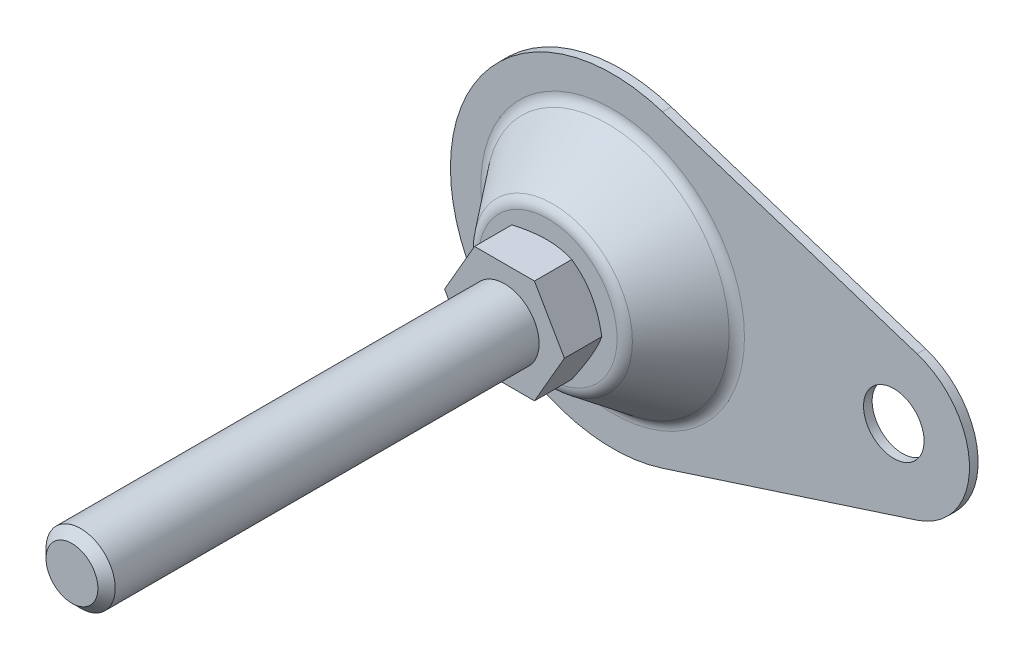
ISO-10303-21;
HEADER;
FILE_DESCRIPTION(('STEP AP214'),'2;1');
FILE_NAME('part.step','',(''),(''),'','','');
FILE_SCHEMA(('AUTOMOTIVE_DESIGN { 1 0 10303 214 1 1 1 1 }'));
ENDSEC;
DATA;
#1=APPLICATION_CONTEXT('core data for automotive mechanical design processes');
#2=APPLICATION_PROTOCOL_DEFINITION('international standard','automotive_design',2000,#1);
#3=PRODUCT_CONTEXT('',#1,'mechanical');
#4=PRODUCT('Part','Part','',(#3));
#5=PRODUCT_RELATED_PRODUCT_CATEGORY('part','',(#4));
#6=PRODUCT_DEFINITION_FORMATION('','',#4);
#7=PRODUCT_DEFINITION_CONTEXT('part definition',#1,'design');
#8=PRODUCT_DEFINITION('design','',#6,#7);
#9=PRODUCT_DEFINITION_SHAPE('','',#8);
#10=(LENGTH_UNIT() NAMED_UNIT(*) SI_UNIT(.MILLI.,.METRE.));
#11=(NAMED_UNIT(*) PLANE_ANGLE_UNIT() SI_UNIT($,.RADIAN.));
#12=(NAMED_UNIT(*) SI_UNIT($,.STERADIAN.) SOLID_ANGLE_UNIT());
#13=UNCERTAINTY_MEASURE_WITH_UNIT(LENGTH_MEASURE(1.E-05),#10,'distance_accuracy_value','');
#14=(GEOMETRIC_REPRESENTATION_CONTEXT(3) GLOBAL_UNCERTAINTY_ASSIGNED_CONTEXT((#13)) GLOBAL_UNIT_ASSIGNED_CONTEXT((#10,
#11,#12)) REPRESENTATION_CONTEXT('',''));
#15=CARTESIAN_POINT('',(0.,0.,0.));
#16=DIRECTION('',(0.,0.,1.));
#17=DIRECTION('',(1.,0.,0.));
#18=AXIS2_PLACEMENT_3D('',#15,#16,#17);
#19=CARTESIAN_POINT('',(65.,0.,2.));
#20=DIRECTION('',(0.,0.,1.));
#21=DIRECTION('',(1.,0.,0.));
#22=AXIS2_PLACEMENT_3D('',#19,#20,#21);
#23=PLANE('',#22);
#24=CARTESIAN_POINT('',(0.,0.,2.));
#25=DIRECTION('',(0.,0.,1.));
#26=DIRECTION('',(1.,0.,0.));
#27=AXIS2_PLACEMENT_3D('',#24,#25,#26);
#28=CIRCLE('',#27,30.4802116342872);
#29=CARTESIAN_POINT('',(30.4802116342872,0.,2.));
#30=VERTEX_POINT('',#29);
#31=EDGE_CURVE('E245',#30,#30,#28,.F.);
#32=ORIENTED_EDGE('',*,*,#31,.T.);
#33=EDGE_LOOP('',(#32));
#34=FACE_BOUND('',#33,.T.);
#35=CARTESIAN_POINT('',(65.,0.,2.));
#36=DIRECTION('',(0.,0.,1.));
#37=DIRECTION('',(1.,0.,0.));
#38=AXIS2_PLACEMENT_3D('',#35,#36,#37);
#39=CIRCLE('',#38,7.);
#40=CARTESIAN_POINT('',(72.,0.,2.));
#41=VERTEX_POINT('',#40);
#42=EDGE_CURVE('E262',#41,#41,#39,.T.);
#43=ORIENTED_EDGE('',*,*,#42,.F.);
#44=EDGE_LOOP('',(#43));
#45=FACE_BOUND('',#44,.T.);
#46=DIRECTION('',(-0.951485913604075,0.307692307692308,0.));
#47=VECTOR('',#46,1.);
#48=CARTESIAN_POINT('',(11.5384615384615,35.6807217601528,2.));
#49=LINE('',#48,#47);
#50=CARTESIAN_POINT('',(70.3846153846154,16.6510034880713,2.));
#51=VERTEX_POINT('',#50);
#52=CARTESIAN_POINT('',(11.5384615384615,35.6807217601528,2.));
#53=VERTEX_POINT('',#52);
#54=EDGE_CURVE('E112',#51,#53,#49,.T.);
#55=ORIENTED_EDGE('',*,*,#54,.T.);
#56=CARTESIAN_POINT('',(0.,0.,2.));
#57=DIRECTION('',(0.,0.,1.));
#58=DIRECTION('',(1.,0.,0.));
#59=AXIS2_PLACEMENT_3D('',#56,#57,#58);
#60=CIRCLE('',#59,37.5);
#61=CARTESIAN_POINT('',(11.5384615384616,-35.6807217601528,2.));
#62=VERTEX_POINT('',#61);
#63=EDGE_CURVE('E114',#53,#62,#60,.T.);
#64=ORIENTED_EDGE('',*,*,#63,.T.);
#65=DIRECTION('',(0.951485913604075,0.307692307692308,0.));
#66=VECTOR('',#65,1.);
#67=CARTESIAN_POINT('',(11.5384615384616,-35.6807217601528,2.));
#68=LINE('',#67,#66);
#69=CARTESIAN_POINT('',(70.3846153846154,-16.6510034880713,2.));
#70=VERTEX_POINT('',#69);
#71=EDGE_CURVE('E97',#62,#70,#68,.T.);
#72=ORIENTED_EDGE('',*,*,#71,.T.);
#73=CARTESIAN_POINT('',(65.,0.,2.));
#74=DIRECTION('',(0.,0.,1.));
#75=DIRECTION('',(1.,0.,0.));
#76=AXIS2_PLACEMENT_3D('',#73,#74,#75);
#77=CIRCLE('',#76,17.5);
#78=EDGE_CURVE('E106',#70,#51,#77,.T.);
#79=ORIENTED_EDGE('',*,*,#78,.T.);
#80=EDGE_LOOP('',(#55,#64,#72,#79));
#81=FACE_BOUND('',#80,.T.);
#82=ADVANCED_FACE('F14',(#34,#45,#81),#23,.T.);
#83=CARTESIAN_POINT('',(65.,0.,0.));
#84=DIRECTION('',(0.,0.,1.));
#85=DIRECTION('',(1.,0.,0.));
#86=AXIS2_PLACEMENT_3D('',#83,#84,#85);
#87=PLANE('',#86);
#88=CARTESIAN_POINT('',(65.,0.,0.));
#89=DIRECTION('',(0.,0.,1.));
#90=DIRECTION('',(1.,0.,0.));
#91=AXIS2_PLACEMENT_3D('',#88,#89,#90);
#92=CIRCLE('',#91,7.);
#93=CARTESIAN_POINT('',(72.,0.,0.));
#94=VERTEX_POINT('',#93);
#95=EDGE_CURVE('E258',#94,#94,#92,.T.);
#96=ORIENTED_EDGE('',*,*,#95,.T.);
#97=EDGE_LOOP('',(#96));
#98=FACE_BOUND('',#97,.T.);
#99=CARTESIAN_POINT('',(0.,0.,0.));
#100=DIRECTION('',(0.,0.,1.));
#101=DIRECTION('',(1.,0.,0.));
#102=AXIS2_PLACEMENT_3D('',#99,#100,#101);
#103=CIRCLE('',#102,37.5);
#104=CARTESIAN_POINT('',(11.5384615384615,35.6807217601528,0.));
#105=VERTEX_POINT('',#104);
#106=CARTESIAN_POINT('',(11.5384615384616,-35.6807217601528,0.));
#107=VERTEX_POINT('',#106);
#108=EDGE_CURVE('E275',#105,#107,#103,.T.);
#109=ORIENTED_EDGE('',*,*,#108,.F.);
#110=DIRECTION('',(-0.951485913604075,0.307692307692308,0.));
#111=VECTOR('',#110,1.);
#112=CARTESIAN_POINT('',(70.3846153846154,16.6510034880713,0.));
#113=LINE('',#112,#111);
#114=CARTESIAN_POINT('',(70.3846153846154,16.6510034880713,0.));
#115=VERTEX_POINT('',#114);
#116=EDGE_CURVE('E9',#115,#105,#113,.T.);
#117=ORIENTED_EDGE('',*,*,#116,.F.);
#118=CARTESIAN_POINT('',(65.,0.,0.));
#119=DIRECTION('',(0.,0.,1.));
#120=DIRECTION('',(1.,0.,0.));
#121=AXIS2_PLACEMENT_3D('',#118,#119,#120);
#122=CIRCLE('',#121,17.5);
#123=CARTESIAN_POINT('',(70.3846153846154,-16.6510034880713,0.));
#124=VERTEX_POINT('',#123);
#125=EDGE_CURVE('E22',#124,#115,#122,.T.);
#126=ORIENTED_EDGE('',*,*,#125,.F.);
#127=DIRECTION('',(0.951485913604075,0.307692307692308,0.));
#128=VECTOR('',#127,1.);
#129=CARTESIAN_POINT('',(70.3846153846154,-16.6510034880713,0.));
#130=LINE('',#129,#128);
#131=EDGE_CURVE('E99',#107,#124,#130,.T.);
#132=ORIENTED_EDGE('',*,*,#131,.F.);
#133=EDGE_LOOP('',(#109,#117,#126,#132));
#134=FACE_BOUND('',#133,.T.);
#135=ADVANCED_FACE('F215',(#98,#134),#87,.F.);
#136=CARTESIAN_POINT('',(0.,0.,17.));
#137=DIRECTION('',(0.,0.,-1.));
#138=DIRECTION('',(-1.,0.,0.));
#139=AXIS2_PLACEMENT_3D('',#136,#137,#138);
#140=PLANE('',#139);
#141=CARTESIAN_POINT('',(0.,0.,17.));
#142=DIRECTION('',(0.,0.,-1.));
#143=DIRECTION('',(-1.,0.,0.));
#144=AXIS2_PLACEMENT_3D('',#141,#142,#143);
#145=CIRCLE('',#144,16.0197883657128);
#146=CARTESIAN_POINT('',(-16.0197883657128,0.,17.));
#147=VERTEX_POINT('',#146);
#148=EDGE_CURVE('E278',#147,#147,#145,.F.);
#149=ORIENTED_EDGE('',*,*,#148,.T.);
#150=EDGE_LOOP('',(#149));
#151=FACE_BOUND('',#150,.T.);
#152=CARTESIAN_POINT('',(0.,0.,17.));
#153=DIRECTION('',(0.,0.,-1.));
#154=DIRECTION('',(-1.,0.,0.));
#155=AXIS2_PLACEMENT_3D('',#152,#153,#154);
#156=CIRCLE('',#155,11.5);
#157=CARTESIAN_POINT('',(-11.5,0.,17.));
#158=VERTEX_POINT('',#157);
#159=EDGE_CURVE('E122',#158,#158,#156,.T.);
#160=ORIENTED_EDGE('',*,*,#159,.T.);
#161=EDGE_LOOP('',(#160));
#162=FACE_BOUND('',#161,.T.);
#163=ADVANCED_FACE('F211',(#151,#162),#140,.F.);
#164=CARTESIAN_POINT('',(0.,0.,5.));
#165=DIRECTION('',(0.,0.,1.));
#166=DIRECTION('',(1.,0.,0.));
#167=AXIS2_PLACEMENT_3D('',#164,#165,#166);
#168=TOROIDAL_SURFACE('',#167,30.4802116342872,3.);
#169=CARTESIAN_POINT('',(0.,0.,3.1747053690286));
#170=DIRECTION('',(0.,0.,1.));
#171=DIRECTION('',(1.,0.,0.));
#172=AXIS2_PLACEMENT_3D('',#169,#170,#171);
#173=CIRCLE('',#172,28.0993925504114);
#174=CARTESIAN_POINT('',(28.0993925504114,0.,3.1747053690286));
#175=VERTEX_POINT('',#174);
#176=EDGE_CURVE('E242',#175,#175,#173,.T.);
#177=ORIENTED_EDGE('',*,*,#176,.F.);
#178=EDGE_LOOP('',(#177));
#179=FACE_BOUND('',#178,.T.);
#180=ORIENTED_EDGE('',*,*,#31,.F.);
#181=EDGE_LOOP('',(#180));
#182=FACE_BOUND('',#181,.T.);
#183=ADVANCED_FACE('F214',(#179,#182),#168,.F.);
#184=CARTESIAN_POINT('',(0.,0.,14.));
#185=DIRECTION('',(0.,0.,-1.));
#186=DIRECTION('',(-1.,0.,0.));
#187=AXIS2_PLACEMENT_3D('',#184,#185,#186);
#188=TOROIDAL_SURFACE('',#187,16.0197883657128,3.);
#189=ORIENTED_EDGE('',*,*,#148,.F.);
#190=EDGE_LOOP('',(#189));
#191=FACE_BOUND('',#190,.T.);
#192=CARTESIAN_POINT('',(0.,0.,15.8252946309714));
#193=DIRECTION('',(0.,0.,1.));
#194=DIRECTION('',(1.,0.,0.));
#195=AXIS2_PLACEMENT_3D('',#192,#193,#194);
#196=CIRCLE('',#195,18.4006074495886);
#197=CARTESIAN_POINT('',(18.4006074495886,0.,15.8252946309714));
#198=VERTEX_POINT('',#197);
#199=EDGE_CURVE('E251',#198,#198,#196,.F.);
#200=ORIENTED_EDGE('',*,*,#199,.F.);
#201=EDGE_LOOP('',(#200));
#202=FACE_BOUND('',#201,.T.);
#203=ADVANCED_FACE('F229',(#191,#202),#188,.T.);
#204=CARTESIAN_POINT('',(0.,0.,2.));
#205=DIRECTION('',(0.,0.,-1.));
#206=DIRECTION('',(-1.,0.,0.));
#207=AXIS2_PLACEMENT_3D('',#204,#205,#206);
#208=CYLINDRICAL_SURFACE('',#207,37.5);
#209=ORIENTED_EDGE('',*,*,#108,.T.);
#210=DIRECTION('',(0.,0.,1.));
#211=VECTOR('',#210,1.);
#212=CARTESIAN_POINT('',(11.5384615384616,-35.6807217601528,-8.));
#213=LINE('',#212,#211);
#214=EDGE_CURVE('E103',#107,#62,#213,.T.);
#215=ORIENTED_EDGE('',*,*,#214,.T.);
#216=ORIENTED_EDGE('',*,*,#63,.F.);
#217=DIRECTION('',(0.,0.,1.));
#218=VECTOR('',#217,1.);
#219=CARTESIAN_POINT('',(11.5384615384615,35.6807217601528,-8.));
#220=LINE('',#219,#218);
#221=EDGE_CURVE('E119',#105,#53,#220,.T.);
#222=ORIENTED_EDGE('',*,*,#221,.F.);
#223=EDGE_LOOP('',(#209,#215,#216,#222));
#224=FACE_BOUND('',#223,.T.);
#225=ADVANCED_FACE('F219',(#224),#208,.T.);
#226=CARTESIAN_POINT('',(65.,0.,2.));
#227=DIRECTION('',(0.,0.,-1.));
#228=DIRECTION('',(-1.,0.,0.));
#229=AXIS2_PLACEMENT_3D('',#226,#227,#228);
#230=CYLINDRICAL_SURFACE('',#229,7.);
#231=ORIENTED_EDGE('',*,*,#42,.T.);
#232=EDGE_LOOP('',(#231));
#233=FACE_BOUND('',#232,.T.);
#234=ORIENTED_EDGE('',*,*,#95,.F.);
#235=EDGE_LOOP('',(#234));
#236=FACE_BOUND('',#235,.T.);
#237=ADVANCED_FACE('F209',(#233,#236),#230,.F.);
#238=CARTESIAN_POINT('',(0.,0.,2.));
#239=DIRECTION('',(0.,0.,-1.));
#240=DIRECTION('',(-1.,0.,0.));
#241=AXIS2_PLACEMENT_3D('',#238,#239,#240);
#242=CONICAL_SURFACE('',#241,29.,0.654082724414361);
#243=ORIENTED_EDGE('',*,*,#176,.T.);
#244=EDGE_LOOP('',(#243));
#245=FACE_BOUND('',#244,.T.);
#246=ORIENTED_EDGE('',*,*,#199,.T.);
#247=EDGE_LOOP('',(#246));
#248=FACE_BOUND('',#247,.T.);
#249=ADVANCED_FACE('F151',(#245,#248),#242,.T.);
#250=CARTESIAN_POINT('',(0.,0.,17.));
#251=DIRECTION('',(0.,0.,1.));
#252=DIRECTION('',(1.,0.,0.));
#253=AXIS2_PLACEMENT_3D('',#250,#251,#252);
#254=CONICAL_SURFACE('',#253,11.5,1.0471975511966);
#255=ORIENTED_EDGE('',*,*,#159,.F.);
#256=EDGE_LOOP('',(#255));
#257=FACE_BOUND('',#256,.T.);
#258=CARTESIAN_POINT('',(13.8565219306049,0.000200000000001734,18.3605385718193));
#259=CARTESIAN_POINT('',(13.7042251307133,-0.263585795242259,18.2726247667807));
#260=CARTESIAN_POINT('',(13.5513604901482,-0.528355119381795,18.1887011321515));
#261=CARTESIAN_POINT('',(13.244405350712,-1.06001701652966,18.0299413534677));
#262=CARTESIAN_POINT('',(13.0903144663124,-1.32691025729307,17.9551081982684));
#263=CARTESIAN_POINT('',(12.6255589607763,-2.13189040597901,17.745692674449));
#264=CARTESIAN_POINT('',(12.3130596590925,-2.6731550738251,17.6265783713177));
#265=CARTESIAN_POINT('',(11.8454187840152,-3.48313282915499,17.486906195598));
#266=CARTESIAN_POINT('',(11.6916742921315,-3.74942610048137,17.4471189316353));
#267=CARTESIAN_POINT('',(11.3834734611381,-4.28324559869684,17.3803985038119));
#268=CARTESIAN_POINT('',(11.2290171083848,-4.55077184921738,17.3534655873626));
#269=CARTESIAN_POINT('',(10.9198468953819,-5.08627036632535,17.3131437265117));
#270=CARTESIAN_POINT('',(10.7651335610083,-5.35424172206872,17.2997386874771));
#271=CARTESIAN_POINT('',(10.4555635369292,-5.89043273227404,17.286758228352));
#272=CARTESIAN_POINT('',(10.3007068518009,-6.15865237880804,17.2871823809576));
#273=CARTESIAN_POINT('',(10.0112020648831,-6.66008937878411,17.3008951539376));
#274=CARTESIAN_POINT('',(9.87653331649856,-6.89334249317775,17.3125111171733));
#275=CARTESIAN_POINT('',(9.60750555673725,-7.35931224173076,17.3459831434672));
#276=CARTESIAN_POINT('',(9.47314656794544,-7.59202883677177,17.367839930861));
#277=CARTESIAN_POINT('',(9.2048113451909,-8.05679907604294,17.4214125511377));
#278=CARTESIAN_POINT('',(9.07083551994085,-8.288852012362,17.4531365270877));
#279=CARTESIAN_POINT('',(8.80351197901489,-8.75186996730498,17.5258869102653));
#280=CARTESIAN_POINT('',(8.67016430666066,-8.98283491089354,17.566913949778));
#281=CARTESIAN_POINT('',(8.2653799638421,-9.68394195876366,17.7049867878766));
#282=CARTESIAN_POINT('',(7.99511549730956,-10.1520537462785,17.8158000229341));
#283=CARTESIAN_POINT('',(7.45861659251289,-11.0812971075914,18.0673009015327));
#284=CARTESIAN_POINT('',(7.19237528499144,-11.5424405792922,18.2079294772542));
#285=CARTESIAN_POINT('',(6.92808776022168,-12.0002,18.3605385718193));
#286=B_SPLINE_CURVE_WITH_KNOTS('',3,(#258,#259,#260,#261,#262,#263,#264,#265,#266,#267,#268,
#269,#270,#271,#272,#273,#274,#275,#276,#277,#278,#279,#280,#281,#282,#283,#284,#285),
.UNSPECIFIED.,.F.,.F.,(4,2,2,2,2,2,2,2,2,2,2,2,2,4),(0.,0.951004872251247,1.90232158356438,
3.80900466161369,4.7389455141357,5.6689042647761,6.59775529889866,7.5265776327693,
8.33514643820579,9.1437724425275,9.95306755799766,10.7624176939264,12.4167102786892,
14.0677556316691),.UNSPECIFIED.);
#287=CARTESIAN_POINT('',(13.856406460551,0.,18.3604719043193));
#288=VERTEX_POINT('',#287);
#289=CARTESIAN_POINT('',(6.92820323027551,-12.,18.3604719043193));
#290=VERTEX_POINT('',#289);
#291=EDGE_CURVE('E29',#288,#290,#286,.T.);
#292=ORIENTED_EDGE('',*,*,#291,.T.);
#293=CARTESIAN_POINT('',(-18.5568714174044,-12.,23.1192267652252));
#294=CARTESIAN_POINT('',(-18.2949973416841,-12.,22.9922690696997));
#295=CARTESIAN_POINT('',(-18.0328144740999,-12.,22.8659486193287));
#296=CARTESIAN_POINT('',(-17.50776668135,-12.,22.6147266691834));
#297=CARTESIAN_POINT('',(-17.2449017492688,-12.,22.489825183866));
#298=CARTESIAN_POINT('',(-16.4551163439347,-12.,22.1174325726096));
#299=CARTESIAN_POINT('',(-15.9270836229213,-12.,21.8722913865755));
#300=CARTESIAN_POINT('',(-14.8645676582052,-12.,21.3884378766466));
#301=CARTESIAN_POINT('',(-14.3300649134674,-12.,21.1497682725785));
#302=CARTESIAN_POINT('',(-13.2567889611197,-12.,20.6822666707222));
#303=CARTESIAN_POINT('',(-12.7180159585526,-12.,20.4534342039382));
#304=CARTESIAN_POINT('',(-11.618348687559,-12.,20.001224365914));
#305=CARTESIAN_POINT('',(-11.0572906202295,-12.,19.7782432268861));
#306=CARTESIAN_POINT('',(-9.92858750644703,-12.,19.3492852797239));
#307=CARTESIAN_POINT('',(-9.36094172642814,-12.,19.1433103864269));
#308=CARTESIAN_POINT('',(-8.2192576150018,-12.,18.7538127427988));
#309=CARTESIAN_POINT('',(-7.64523505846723,-12.,18.570244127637));
#310=CARTESIAN_POINT('',(-6.48890289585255,-12.,18.2314734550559));
#311=CARTESIAN_POINT('',(-5.9065959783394,-12.,18.0762624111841));
#312=CARTESIAN_POINT('',(-5.02838211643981,-12.,17.8707664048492));
#313=CARTESIAN_POINT('',(-4.73562132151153,-12.,17.8069522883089));
#314=CARTESIAN_POINT('',(-4.14810934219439,-12.,17.6892035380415));
#315=CARTESIAN_POINT('',(-3.85335819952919,-12.,17.6352686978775));
#316=CARTESIAN_POINT('',(-3.26207336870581,-12.,17.5382338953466));
#317=CARTESIAN_POINT('',(-2.96553970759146,-12.,17.4951337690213));
#318=CARTESIAN_POINT('',(-2.37100779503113,-12.,17.420629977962));
#319=CARTESIAN_POINT('',(-2.07300960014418,-12.,17.389225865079));
#320=CARTESIAN_POINT('',(-1.47983530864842,-12.,17.339128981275));
#321=CARTESIAN_POINT('',(-1.18467278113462,-12.,17.3202765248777));
#322=CARTESIAN_POINT('',(-0.593815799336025,-12.,17.295066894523));
#323=CARTESIAN_POINT('',(-0.298121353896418,-12.,17.2887095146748));
#324=CARTESIAN_POINT('',(0.293275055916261,-12.,17.2886410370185));
#325=CARTESIAN_POINT('',(0.588977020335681,-12.,17.2949301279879));
#326=CARTESIAN_POINT('',(1.17985434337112,-12.,17.3200023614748));
#327=CARTESIAN_POINT('',(1.4750296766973,-12.,17.3387860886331));
#328=CARTESIAN_POINT('',(2.18588427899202,-12.,17.3986711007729));
#329=CARTESIAN_POINT('',(2.60106611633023,-12.,17.4457810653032));
#330=CARTESIAN_POINT('',(3.42831720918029,-12.,17.5621435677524));
#331=CARTESIAN_POINT('',(3.84038602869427,-12.,17.6313991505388));
#332=CARTESIAN_POINT('',(4.66102256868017,-12.,17.789589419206));
#333=CARTESIAN_POINT('',(5.06958733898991,-12.,17.8785392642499));
#334=CARTESIAN_POINT('',(5.88260453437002,-12.,18.0734091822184));
#335=CARTESIAN_POINT('',(6.28705702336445,-12.,18.1793289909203));
#336=CARTESIAN_POINT('',(7.1010339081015,-12.,18.4081510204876));
#337=CARTESIAN_POINT('',(7.51046449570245,-12.,18.5313846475));
#338=CARTESIAN_POINT('',(8.32528999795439,-12.,18.790473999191));
#339=CARTESIAN_POINT('',(8.73068488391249,-12.,18.9263298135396));
#340=CARTESIAN_POINT('',(9.53764539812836,-12.,19.2085154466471));
#341=CARTESIAN_POINT('',(9.93921224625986,-12.,19.3548417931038));
#342=CARTESIAN_POINT('',(10.7390213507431,-12.,19.656257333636));
#343=CARTESIAN_POINT('',(11.1372636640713,-12.,19.8113463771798));
#344=CARTESIAN_POINT('',(12.1496209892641,-12.,20.2163648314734));
#345=CARTESIAN_POINT('',(12.7616780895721,-12.,20.4714330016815));
#346=CARTESIAN_POINT('',(13.9800590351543,-12.,20.9949561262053));
#347=CARTESIAN_POINT('',(14.5863823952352,-12.,21.2634122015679));
#348=CARTESIAN_POINT('',(15.7945086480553,-12.,21.8107456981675));
#349=CARTESIAN_POINT('',(16.3963101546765,-12.,22.0896261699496));
#350=CARTESIAN_POINT('',(17.5960622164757,-12.,22.6554817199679));
#351=CARTESIAN_POINT('',(18.1940128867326,-12.,22.9424565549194));
#352=CARTESIAN_POINT('',(19.3875653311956,-12.,23.5232279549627));
#353=CARTESIAN_POINT('',(19.983162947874,-12.,23.817033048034));
#354=CARTESIAN_POINT('',(21.1717673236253,-12.,24.4098391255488));
#355=CARTESIAN_POINT('',(21.7647740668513,-12.,24.7088401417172));
#356=CARTESIAN_POINT('',(22.9485322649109,-12.,25.3110215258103));
#357=CARTESIAN_POINT('',(23.5392840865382,-12.,25.614201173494));
#358=CARTESIAN_POINT('',(24.718984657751,-12.,26.2240502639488));
#359=CARTESIAN_POINT('',(25.3079334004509,-12.,26.5307197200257));
#360=CARTESIAN_POINT('',(26.9601720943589,-12.,27.3962182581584));
#361=CARTESIAN_POINT('',(28.0217414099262,-12.,27.9583316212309));
#362=CARTESIAN_POINT('',(30.1412251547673,-12.,29.089510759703));
#363=CARTESIAN_POINT('',(31.1991394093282,-12.,29.6585768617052));
#364=CARTESIAN_POINT('',(33.3091162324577,-12.,30.8003212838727));
#365=CARTESIAN_POINT('',(34.3611868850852,-12.,31.372984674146));
#366=CARTESIAN_POINT('',(35.9376034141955,-12.,32.2349857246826));
#367=CARTESIAN_POINT('',(36.4627773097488,-12.,32.5228111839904));
#368=CARTESIAN_POINT('',(37.5126305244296,-12.,33.0993611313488));
#369=CARTESIAN_POINT('',(38.0373098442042,-12.,33.3880856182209));
#370=CARTESIAN_POINT('',(38.5617712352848,-12.,33.6772055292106));
#371=B_SPLINE_CURVE_WITH_KNOTS('',3,(#293,#294,#295,#296,#297,#298,#299,#300,#301,#302,#303,
#304,#305,#306,#307,#308,#309,#310,#311,#312,#313,#314,#315,#316,#317,#318,#319,#320,#321,#322,
#323,#324,#325,#326,#327,#328,#329,#330,#331,#332,#333,#334,#335,#336,#337,#338,#339,#340,#341,
#342,#343,#344,#345,#346,#347,#348,#349,#350,#351,#352,#353,#354,#355,#356,#357,#358,#359,#360,
#361,#362,#363,#364,#365,#366,#367,#368,#369,#370),.UNSPECIFIED.,.F.,.F.,(4,2,2,2,2,2,2,2,2,2,2,
2,2,2,2,2,2,2,2,2,2,2,2,2,2,2,2,2,2,2,2,2,2,2,2,2,2,2,4),(0.,0.873077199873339,1.7461632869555,
3.49259683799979,5.24862535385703,7.00457005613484,8.81559139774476,10.6268163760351,
12.4342693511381,14.2411485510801,15.1399137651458,16.0386601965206,16.9373930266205,
17.8360914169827,18.7231259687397,19.610145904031,20.4971790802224,21.3842537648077,
22.6370979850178,23.8901145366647,25.1440989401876,26.3980638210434,27.6805436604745,
28.9630326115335,30.2450982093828,31.5271417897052,33.5161486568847,35.5053223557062,
37.4950827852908,39.4847834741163,41.4771182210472,43.4694651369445,45.4614728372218,
47.45348813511,51.0570725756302,54.6608269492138,58.2543038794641,60.0509278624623,
61.8475494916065),.UNSPECIFIED.);
#372=CARTESIAN_POINT('',(-6.92820323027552,-12.,18.3604719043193));
#373=VERTEX_POINT('',#372);
#374=EDGE_CURVE('E158',#290,#373,#371,.F.);
#375=ORIENTED_EDGE('',*,*,#374,.T.);
#376=CARTESIAN_POINT('',(-6.92808776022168,-12.0002,18.3605385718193));
#377=CARTESIAN_POINT('',(-7.0803845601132,-11.7364142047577,18.2726247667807));
#378=CARTESIAN_POINT('',(-7.23324920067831,-11.4716448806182,18.1887011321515));
#379=CARTESIAN_POINT('',(-7.5402043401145,-10.9399829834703,18.0299413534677));
#380=CARTESIAN_POINT('',(-7.69429522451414,-10.6730897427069,17.9551081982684));
#381=CARTESIAN_POINT('',(-8.15905073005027,-9.86810959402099,17.745692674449));
#382=CARTESIAN_POINT('',(-8.47155003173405,-9.3268449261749,17.6265783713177));
#383=CARTESIAN_POINT('',(-8.93919090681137,-8.51686717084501,17.486906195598));
#384=CARTESIAN_POINT('',(-9.09293539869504,-8.25057389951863,17.4471189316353));
#385=CARTESIAN_POINT('',(-9.40113622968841,-7.71675440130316,17.3803985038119));
#386=CARTESIAN_POINT('',(-9.55559258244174,-7.44922815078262,17.3534655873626));
#387=CARTESIAN_POINT('',(-9.86476279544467,-6.91372963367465,17.3131437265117));
#388=CARTESIAN_POINT('',(-10.0194761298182,-6.64575827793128,17.2997386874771));
#389=CARTESIAN_POINT('',(-10.3290461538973,-6.10956726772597,17.286758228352));
#390=CARTESIAN_POINT('',(-10.4839028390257,-5.84134762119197,17.2871823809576));
#391=CARTESIAN_POINT('',(-10.7734076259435,-5.3399106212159,17.3008951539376));
#392=CARTESIAN_POINT('',(-10.908076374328,-5.10665750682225,17.3125111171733));
#393=CARTESIAN_POINT('',(-11.1771041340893,-4.64068775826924,17.3459831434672));
#394=CARTESIAN_POINT('',(-11.3114631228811,-4.40797116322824,17.367839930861));
#395=CARTESIAN_POINT('',(-11.5797983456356,-3.94320092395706,17.4214125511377));
#396=CARTESIAN_POINT('',(-11.7137741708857,-3.711147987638,17.4531365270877));
#397=CARTESIAN_POINT('',(-11.9810977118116,-3.24813003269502,17.5258869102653));
#398=CARTESIAN_POINT('',(-12.1144453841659,-3.01716508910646,17.566913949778));
#399=CARTESIAN_POINT('',(-12.5192297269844,-2.31605804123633,17.7049867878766));
#400=CARTESIAN_POINT('',(-12.789494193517,-1.84794625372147,17.8158000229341));
#401=CARTESIAN_POINT('',(-13.3259930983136,-0.91870289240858,18.0673009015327));
#402=CARTESIAN_POINT('',(-13.5922344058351,-0.457559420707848,18.2079294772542));
#403=CARTESIAN_POINT('',(-13.8565219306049,0.000199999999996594,18.3605385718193));
#404=B_SPLINE_CURVE_WITH_KNOTS('',3,(#376,#377,#378,#379,#380,#381,#382,#383,#384,#385,#386,
#387,#388,#389,#390,#391,#392,#393,#394,#395,#396,#397,#398,#399,#400,#401,#402,#403),
.UNSPECIFIED.,.F.,.F.,(4,2,2,2,2,2,2,2,2,2,2,2,2,4),(0.,0.951004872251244,1.90232158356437,
3.80900466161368,4.7389455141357,5.66890426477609,6.59775529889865,7.52657763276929,
8.33514643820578,9.14377244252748,9.95306755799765,10.7624176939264,12.4167102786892,
14.0677556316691),.UNSPECIFIED.);
#405=CARTESIAN_POINT('',(-13.856406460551,0.,18.3604719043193));
#406=VERTEX_POINT('',#405);
#407=EDGE_CURVE('E127',#373,#406,#404,.T.);
#408=ORIENTED_EDGE('',*,*,#407,.T.);
#409=CARTESIAN_POINT('',(-13.8565219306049,-0.000200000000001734,18.3605385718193));
#410=CARTESIAN_POINT('',(-13.7042251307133,0.263585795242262,18.2726247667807));
#411=CARTESIAN_POINT('',(-13.5513604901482,0.5283551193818,18.1887011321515));
#412=CARTESIAN_POINT('',(-13.244405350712,1.06001701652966,18.0299413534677));
#413=CARTESIAN_POINT('',(-13.0903144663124,1.32691025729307,17.9551081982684));
#414=CARTESIAN_POINT('',(-12.6255589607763,2.13189040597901,17.745692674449));
#415=CARTESIAN_POINT('',(-12.3130596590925,2.6731550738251,17.6265783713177));
#416=CARTESIAN_POINT('',(-11.8454187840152,3.483132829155,17.486906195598));
#417=CARTESIAN_POINT('',(-11.6916742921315,3.74942610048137,17.4471189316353));
#418=CARTESIAN_POINT('',(-11.3834734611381,4.28324559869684,17.3803985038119));
#419=CARTESIAN_POINT('',(-11.2290171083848,4.55077184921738,17.3534655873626));
#420=CARTESIAN_POINT('',(-10.9198468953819,5.08627036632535,17.3131437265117));
#421=CARTESIAN_POINT('',(-10.7651335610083,5.35424172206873,17.2997386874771));
#422=CARTESIAN_POINT('',(-10.4555635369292,5.89043273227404,17.286758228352));
#423=CARTESIAN_POINT('',(-10.3007068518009,6.15865237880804,17.2871823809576));
#424=CARTESIAN_POINT('',(-10.0112020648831,6.66008937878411,17.3008951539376));
#425=CARTESIAN_POINT('',(-9.87653331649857,6.89334249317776,17.3125111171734));
#426=CARTESIAN_POINT('',(-9.60750555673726,7.35931224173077,17.3459831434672));
#427=CARTESIAN_POINT('',(-9.47314656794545,7.59202883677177,17.367839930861));
#428=CARTESIAN_POINT('',(-9.20481134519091,8.05679907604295,17.4214125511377));
#429=CARTESIAN_POINT('',(-9.07083551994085,8.28885201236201,17.4531365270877));
#430=CARTESIAN_POINT('',(-8.80351197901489,8.75186996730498,17.5258869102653));
#431=CARTESIAN_POINT('',(-8.67016430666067,8.98283491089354,17.566913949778));
#432=CARTESIAN_POINT('',(-8.26537996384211,9.68394195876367,17.7049867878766));
#433=CARTESIAN_POINT('',(-7.99511549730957,10.1520537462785,17.8158000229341));
#434=CARTESIAN_POINT('',(-7.4586165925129,11.0812971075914,18.0673009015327));
#435=CARTESIAN_POINT('',(-7.19237528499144,11.5424405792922,18.2079294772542));
#436=CARTESIAN_POINT('',(-6.92808776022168,12.0002,18.3605385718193));
#437=B_SPLINE_CURVE_WITH_KNOTS('',3,(#409,#410,#411,#412,#413,#414,#415,#416,#417,#418,#419,
#420,#421,#422,#423,#424,#425,#426,#427,#428,#429,#430,#431,#432,#433,#434,#435,#436),
.UNSPECIFIED.,.F.,.F.,(4,2,2,2,2,2,2,2,2,2,2,2,2,4),(0.,0.951004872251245,1.90232158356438,
3.80900466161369,4.7389455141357,5.66890426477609,6.59775529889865,7.5265776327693,
8.33514643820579,9.14377244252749,9.95306755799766,10.7624176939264,12.4167102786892,
14.0677556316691),.UNSPECIFIED.);
#438=CARTESIAN_POINT('',(-6.92820323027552,12.,18.3604719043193));
#439=VERTEX_POINT('',#438);
#440=EDGE_CURVE('E135',#406,#439,#437,.T.);
#441=ORIENTED_EDGE('',*,*,#440,.T.);
#442=CARTESIAN_POINT('',(-18.5568714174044,12.,23.1192267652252));
#443=CARTESIAN_POINT('',(-18.2949973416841,12.,22.9922690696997));
#444=CARTESIAN_POINT('',(-18.0328144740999,12.,22.8659486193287));
#445=CARTESIAN_POINT('',(-17.50776668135,12.,22.6147266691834));
#446=CARTESIAN_POINT('',(-17.2449017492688,12.,22.489825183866));
#447=CARTESIAN_POINT('',(-16.4551163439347,12.,22.1174325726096));
#448=CARTESIAN_POINT('',(-15.9270836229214,12.,21.8722913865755));
#449=CARTESIAN_POINT('',(-14.8645676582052,12.,21.3884378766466));
#450=CARTESIAN_POINT('',(-14.3300649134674,12.,21.1497682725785));
#451=CARTESIAN_POINT('',(-13.2567889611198,12.,20.6822666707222));
#452=CARTESIAN_POINT('',(-12.7180159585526,12.,20.4534342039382));
#453=CARTESIAN_POINT('',(-11.618348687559,12.,20.001224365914));
#454=CARTESIAN_POINT('',(-11.0572906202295,12.,19.7782432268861));
#455=CARTESIAN_POINT('',(-9.92858750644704,12.,19.3492852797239));
#456=CARTESIAN_POINT('',(-9.36094172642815,12.,19.1433103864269));
#457=CARTESIAN_POINT('',(-8.21925761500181,12.,18.7538127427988));
#458=CARTESIAN_POINT('',(-7.64523505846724,12.,18.570244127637));
#459=CARTESIAN_POINT('',(-6.48890289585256,12.,18.2314734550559));
#460=CARTESIAN_POINT('',(-5.90659597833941,12.,18.0762624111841));
#461=CARTESIAN_POINT('',(-5.02838211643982,12.,17.8707664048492));
#462=CARTESIAN_POINT('',(-4.73562132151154,12.,17.8069522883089));
#463=CARTESIAN_POINT('',(-4.1481093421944,12.,17.6892035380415));
#464=CARTESIAN_POINT('',(-3.8533581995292,12.,17.6352686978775));
#465=CARTESIAN_POINT('',(-3.26207336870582,12.,17.5382338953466));
#466=CARTESIAN_POINT('',(-2.96553970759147,12.,17.4951337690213));
#467=CARTESIAN_POINT('',(-2.37100779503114,12.,17.420629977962));
#468=CARTESIAN_POINT('',(-2.07300960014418,12.,17.389225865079));
#469=CARTESIAN_POINT('',(-1.47983530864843,12.,17.339128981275));
#470=CARTESIAN_POINT('',(-1.18467278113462,12.,17.3202765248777));
#471=CARTESIAN_POINT('',(-0.593815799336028,12.,17.295066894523));
#472=CARTESIAN_POINT('',(-0.298121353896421,12.,17.2887095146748));
#473=CARTESIAN_POINT('',(0.293275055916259,12.,17.2886410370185));
#474=CARTESIAN_POINT('',(0.58897702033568,12.,17.2949301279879));
#475=CARTESIAN_POINT('',(1.17985434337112,12.,17.3200023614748));
#476=CARTESIAN_POINT('',(1.4750296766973,12.,17.3387860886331));
#477=CARTESIAN_POINT('',(2.18588427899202,12.,17.3986711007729));
#478=CARTESIAN_POINT('',(2.60106611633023,12.,17.4457810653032));
#479=CARTESIAN_POINT('',(3.42831720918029,12.,17.5621435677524));
#480=CARTESIAN_POINT('',(3.84038602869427,12.,17.6313991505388));
#481=CARTESIAN_POINT('',(4.66102256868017,12.,17.789589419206));
#482=CARTESIAN_POINT('',(5.06958733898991,12.,17.8785392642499));
#483=CARTESIAN_POINT('',(5.88260453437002,12.,18.0734091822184));
#484=CARTESIAN_POINT('',(6.28705702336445,12.,18.1793289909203));
#485=CARTESIAN_POINT('',(7.1010339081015,12.,18.4081510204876));
#486=CARTESIAN_POINT('',(7.51046449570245,12.,18.5313846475));
#487=CARTESIAN_POINT('',(8.32528999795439,12.,18.790473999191));
#488=CARTESIAN_POINT('',(8.73068488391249,12.,18.9263298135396));
#489=CARTESIAN_POINT('',(9.53764539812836,12.,19.2085154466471));
#490=CARTESIAN_POINT('',(9.93921224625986,12.,19.3548417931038));
#491=CARTESIAN_POINT('',(10.7390213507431,12.,19.656257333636));
#492=CARTESIAN_POINT('',(11.1372636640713,12.,19.8113463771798));
#493=CARTESIAN_POINT('',(12.1496209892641,12.,20.2163648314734));
#494=CARTESIAN_POINT('',(12.7616780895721,12.,20.4714330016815));
#495=CARTESIAN_POINT('',(13.9800590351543,12.,20.9949561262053));
#496=CARTESIAN_POINT('',(14.5863823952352,12.,21.2634122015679));
#497=CARTESIAN_POINT('',(15.7945086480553,12.,21.8107456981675));
#498=CARTESIAN_POINT('',(16.3963101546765,12.,22.0896261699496));
#499=CARTESIAN_POINT('',(17.5960622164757,12.,22.6554817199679));
#500=CARTESIAN_POINT('',(18.1940128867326,12.,22.9424565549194));
#501=CARTESIAN_POINT('',(19.3875653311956,12.,23.5232279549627));
#502=CARTESIAN_POINT('',(19.983162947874,12.,23.817033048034));
#503=CARTESIAN_POINT('',(21.1717673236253,12.,24.4098391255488));
#504=CARTESIAN_POINT('',(21.7647740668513,12.,24.7088401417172));
#505=CARTESIAN_POINT('',(22.9485322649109,12.,25.3110215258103));
#506=CARTESIAN_POINT('',(23.5392840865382,12.,25.614201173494));
#507=CARTESIAN_POINT('',(24.718984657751,12.,26.2240502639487));
#508=CARTESIAN_POINT('',(25.3079334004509,12.,26.5307197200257));
#509=CARTESIAN_POINT('',(26.9601720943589,12.,27.3962182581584));
#510=CARTESIAN_POINT('',(28.0217414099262,12.,27.9583316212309));
#511=CARTESIAN_POINT('',(30.1412251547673,12.,29.089510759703));
#512=CARTESIAN_POINT('',(31.1991394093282,12.,29.6585768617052));
#513=CARTESIAN_POINT('',(33.3091162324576,12.,30.8003212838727));
#514=CARTESIAN_POINT('',(34.3611868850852,12.,31.372984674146));
#515=CARTESIAN_POINT('',(35.9376034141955,12.,32.2349857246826));
#516=CARTESIAN_POINT('',(36.4627773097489,12.,32.5228111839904));
#517=CARTESIAN_POINT('',(37.5126305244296,12.,33.0993611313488));
#518=CARTESIAN_POINT('',(38.0373098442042,12.,33.3880856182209));
#519=CARTESIAN_POINT('',(38.5617712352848,12.,33.6772055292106));
#520=B_SPLINE_CURVE_WITH_KNOTS('',3,(#442,#443,#444,#445,#446,#447,#448,#449,#450,#451,#452,
#453,#454,#455,#456,#457,#458,#459,#460,#461,#462,#463,#464,#465,#466,#467,#468,#469,#470,#471,
#472,#473,#474,#475,#476,#477,#478,#479,#480,#481,#482,#483,#484,#485,#486,#487,#488,#489,#490,
#491,#492,#493,#494,#495,#496,#497,#498,#499,#500,#501,#502,#503,#504,#505,#506,#507,#508,#509,
#510,#511,#512,#513,#514,#515,#516,#517,#518,#519),.UNSPECIFIED.,.F.,.F.,(4,2,2,2,2,2,2,2,2,2,2,
2,2,2,2,2,2,2,2,2,2,2,2,2,2,2,2,2,2,2,2,2,2,2,2,2,2,2,4),(0.,0.873077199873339,1.7461632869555,
3.49259683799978,5.24862535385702,7.00457005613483,8.81559139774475,10.626816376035,
12.4342693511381,14.24114855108,15.1399137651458,16.0386601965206,16.9373930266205,
17.8360914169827,18.7231259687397,19.610145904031,20.4971790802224,21.3842537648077,
22.6370979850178,23.8901145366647,25.1440989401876,26.3980638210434,27.6805436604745,
28.9630326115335,30.2450982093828,31.5271417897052,33.5161486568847,35.5053223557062,
37.4950827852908,39.4847834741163,41.4771182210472,43.4694651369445,45.4614728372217,
47.45348813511,51.0570725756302,54.6608269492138,58.2543038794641,60.0509278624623,
61.8475494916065),.UNSPECIFIED.);
#521=CARTESIAN_POINT('',(6.92820323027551,12.,18.3604719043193));
#522=VERTEX_POINT('',#521);
#523=EDGE_CURVE('E169',#439,#522,#520,.T.);
#524=ORIENTED_EDGE('',*,*,#523,.T.);
#525=CARTESIAN_POINT('',(6.92808776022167,12.0002,18.3605385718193));
#526=CARTESIAN_POINT('',(7.08038456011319,11.7364142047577,18.2726247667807));
#527=CARTESIAN_POINT('',(7.23324920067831,11.4716448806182,18.1887011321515));
#528=CARTESIAN_POINT('',(7.54020434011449,10.9399829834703,18.0299413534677));
#529=CARTESIAN_POINT('',(7.69429522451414,10.6730897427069,17.9551081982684));
#530=CARTESIAN_POINT('',(8.15905073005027,9.868109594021,17.745692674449));
#531=CARTESIAN_POINT('',(8.47155003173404,9.32684492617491,17.6265783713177));
#532=CARTESIAN_POINT('',(8.93919090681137,8.51686717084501,17.486906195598));
#533=CARTESIAN_POINT('',(9.09293539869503,8.25057389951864,17.4471189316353));
#534=CARTESIAN_POINT('',(9.4011362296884,7.71675440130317,17.3803985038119));
#535=CARTESIAN_POINT('',(9.55559258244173,7.44922815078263,17.3534655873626));
#536=CARTESIAN_POINT('',(9.86476279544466,6.91372963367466,17.3131437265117));
#537=CARTESIAN_POINT('',(10.0194761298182,6.64575827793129,17.2997386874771));
#538=CARTESIAN_POINT('',(10.3290461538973,6.10956726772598,17.286758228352));
#539=CARTESIAN_POINT('',(10.4839028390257,5.84134762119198,17.2871823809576));
#540=CARTESIAN_POINT('',(10.7734076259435,5.33991062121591,17.3008951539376));
#541=CARTESIAN_POINT('',(10.908076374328,5.10665750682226,17.3125111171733));
#542=CARTESIAN_POINT('',(11.1771041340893,4.64068775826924,17.3459831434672));
#543=CARTESIAN_POINT('',(11.3114631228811,4.40797116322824,17.367839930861));
#544=CARTESIAN_POINT('',(11.5797983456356,3.94320092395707,17.4214125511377));
#545=CARTESIAN_POINT('',(11.7137741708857,3.71114798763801,17.4531365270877));
#546=CARTESIAN_POINT('',(11.9810977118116,3.24813003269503,17.5258869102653));
#547=CARTESIAN_POINT('',(12.1144453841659,3.01716508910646,17.566913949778));
#548=CARTESIAN_POINT('',(12.5192297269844,2.31605804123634,17.7049867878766));
#549=CARTESIAN_POINT('',(12.789494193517,1.84794625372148,17.8158000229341));
#550=CARTESIAN_POINT('',(13.3259930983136,0.918702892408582,18.0673009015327));
#551=CARTESIAN_POINT('',(13.5922344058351,0.457559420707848,18.2079294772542));
#552=CARTESIAN_POINT('',(13.8565219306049,-0.000199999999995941,18.3605385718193));
#553=B_SPLINE_CURVE_WITH_KNOTS('',3,(#525,#526,#527,#528,#529,#530,#531,#532,#533,#534,#535,
#536,#537,#538,#539,#540,#541,#542,#543,#544,#545,#546,#547,#548,#549,#550,#551,#552),
.UNSPECIFIED.,.F.,.F.,(4,2,2,2,2,2,2,2,2,2,2,2,2,4),(0.,0.951004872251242,1.90232158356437,
3.80900466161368,4.73894551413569,5.66890426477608,6.59775529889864,7.52657763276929,
8.33514643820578,9.14377244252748,9.95306755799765,10.7624176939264,12.4167102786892,
14.0677556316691),.UNSPECIFIED.);
#554=EDGE_CURVE('E176',#522,#288,#553,.T.);
#555=ORIENTED_EDGE('',*,*,#554,.T.);
#556=EDGE_LOOP('',(#292,#375,#408,#441,#524,#555));
#557=FACE_BOUND('',#556,.T.);
#558=ADVANCED_FACE('F145',(#257,#557),#254,.T.);
#559=CARTESIAN_POINT('',(0.,0.,127.));
#560=DIRECTION('',(0.,0.,1.));
#561=DIRECTION('',(1.,0.,0.));
#562=AXIS2_PLACEMENT_3D('',#559,#560,#561);
#563=PLANE('',#562);
#564=CARTESIAN_POINT('',(0.,0.,127.));
#565=DIRECTION('',(0.,0.,1.));
#566=DIRECTION('',(1.,0.,0.));
#567=AXIS2_PLACEMENT_3D('',#564,#565,#566);
#568=CIRCLE('',#567,6.);
#569=CARTESIAN_POINT('',(6.,0.,127.));
#570=VERTEX_POINT('',#569);
#571=EDGE_CURVE('E246',#570,#570,#568,.T.);
#572=ORIENTED_EDGE('',*,*,#571,.T.);
#573=EDGE_LOOP('',(#572));
#574=FACE_BOUND('',#573,.T.);
#575=ADVANCED_FACE('F150',(#574),#563,.T.);
#576=CARTESIAN_POINT('',(0.,0.,127.));
#577=DIRECTION('',(0.,0.,-1.));
#578=DIRECTION('',(-1.,0.,0.));
#579=AXIS2_PLACEMENT_3D('',#576,#577,#578);
#580=CONICAL_SURFACE('',#579,6.,0.785398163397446);
#581=CARTESIAN_POINT('',(0.,0.,125.));
#582=DIRECTION('',(0.,0.,1.));
#583=DIRECTION('',(1.,0.,0.));
#584=AXIS2_PLACEMENT_3D('',#581,#582,#583);
#585=CIRCLE('',#584,8.);
#586=CARTESIAN_POINT('',(8.,0.,125.));
#587=VERTEX_POINT('',#586);
#588=EDGE_CURVE('E249',#587,#587,#585,.F.);
#589=ORIENTED_EDGE('',*,*,#588,.F.);
#590=EDGE_LOOP('',(#589));
#591=FACE_BOUND('',#590,.T.);
#592=ORIENTED_EDGE('',*,*,#571,.F.);
#593=EDGE_LOOP('',(#592));
#594=FACE_BOUND('',#593,.T.);
#595=ADVANCED_FACE('F16',(#591,#594),#580,.T.);
#596=CARTESIAN_POINT('',(0.,0.,127.));
#597=DIRECTION('',(0.,0.,-1.));
#598=DIRECTION('',(-1.,0.,0.));
#599=AXIS2_PLACEMENT_3D('',#596,#597,#598);
#600=CYLINDRICAL_SURFACE('',#599,8.);
#601=CARTESIAN_POINT('',(0.,0.,27.));
#602=DIRECTION('',(0.,0.,1.));
#603=DIRECTION('',(1.,0.,0.));
#604=AXIS2_PLACEMENT_3D('',#601,#602,#603);
#605=CIRCLE('',#604,8.);
#606=CARTESIAN_POINT('',(8.,0.,27.));
#607=VERTEX_POINT('',#606);
#608=EDGE_CURVE('E256',#607,#607,#605,.T.);
#609=ORIENTED_EDGE('',*,*,#608,.T.);
#610=EDGE_LOOP('',(#609));
#611=FACE_BOUND('',#610,.T.);
#612=ORIENTED_EDGE('',*,*,#588,.T.);
#613=EDGE_LOOP('',(#612));
#614=FACE_BOUND('',#613,.T.);
#615=ADVANCED_FACE('F203',(#611,#614),#600,.T.);
#616=CARTESIAN_POINT('',(0.,0.,27.));
#617=DIRECTION('',(0.,0.,1.));
#618=DIRECTION('',(1.,0.,0.));
#619=AXIS2_PLACEMENT_3D('',#616,#617,#618);
#620=PLANE('',#619);
#621=DIRECTION('',(0.5,0.866025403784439,0.));
#622=VECTOR('',#621,1.);
#623=CARTESIAN_POINT('',(6.92820323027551,-12.,27.));
#624=LINE('',#623,#622);
#625=CARTESIAN_POINT('',(6.92820323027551,-12.,27.));
#626=VERTEX_POINT('',#625);
#627=CARTESIAN_POINT('',(13.856406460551,0.,27.));
#628=VERTEX_POINT('',#627);
#629=EDGE_CURVE('E321',#626,#628,#624,.T.);
#630=ORIENTED_EDGE('',*,*,#629,.T.);
#631=DIRECTION('',(-0.5,0.866025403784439,0.));
#632=VECTOR('',#631,1.);
#633=CARTESIAN_POINT('',(13.856406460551,0.,27.));
#634=LINE('',#633,#632);
#635=CARTESIAN_POINT('',(6.92820323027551,12.,27.));
#636=VERTEX_POINT('',#635);
#637=EDGE_CURVE('E320',#628,#636,#634,.T.);
#638=ORIENTED_EDGE('',*,*,#637,.T.);
#639=DIRECTION('',(-1.,0.,0.));
#640=VECTOR('',#639,1.);
#641=CARTESIAN_POINT('',(6.92820323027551,12.,27.));
#642=LINE('',#641,#640);
#643=CARTESIAN_POINT('',(-6.92820323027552,12.,27.));
#644=VERTEX_POINT('',#643);
#645=EDGE_CURVE('E318',#636,#644,#642,.T.);
#646=ORIENTED_EDGE('',*,*,#645,.T.);
#647=DIRECTION('',(-0.5,-0.866025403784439,0.));
#648=VECTOR('',#647,1.);
#649=CARTESIAN_POINT('',(-6.92820323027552,12.,27.));
#650=LINE('',#649,#648);
#651=CARTESIAN_POINT('',(-13.856406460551,0.,27.));
#652=VERTEX_POINT('',#651);
#653=EDGE_CURVE('E314',#644,#652,#650,.T.);
#654=ORIENTED_EDGE('',*,*,#653,.T.);
#655=DIRECTION('',(0.5,-0.866025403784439,0.));
#656=VECTOR('',#655,1.);
#657=CARTESIAN_POINT('',(-13.856406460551,0.,27.));
#658=LINE('',#657,#656);
#659=CARTESIAN_POINT('',(-6.92820323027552,-12.,27.));
#660=VERTEX_POINT('',#659);
#661=EDGE_CURVE('E328',#652,#660,#658,.T.);
#662=ORIENTED_EDGE('',*,*,#661,.T.);
#663=DIRECTION('',(1.,0.,0.));
#664=VECTOR('',#663,1.);
#665=CARTESIAN_POINT('',(-6.92820323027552,-12.,27.));
#666=LINE('',#665,#664);
#667=EDGE_CURVE('E37',#660,#626,#666,.T.);
#668=ORIENTED_EDGE('',*,*,#667,.T.);
#669=EDGE_LOOP('',(#630,#638,#646,#654,#662,#668));
#670=FACE_BOUND('',#669,.T.);
#671=ORIENTED_EDGE('',*,*,#608,.F.);
#672=EDGE_LOOP('',(#671));
#673=FACE_BOUND('',#672,.T.);
#674=ADVANCED_FACE('F154',(#670,#673),#620,.T.);
#675=CARTESIAN_POINT('',(-6.92820323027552,-12.,27.));
#676=DIRECTION('',(0.,1.,0.));
#677=DIRECTION('',(0.,0.,1.));
#678=AXIS2_PLACEMENT_3D('',#675,#676,#677);
#679=PLANE('',#678);
#680=ORIENTED_EDGE('',*,*,#374,.F.);
#681=DIRECTION('',(0.,0.,-1.));
#682=VECTOR('',#681,1.);
#683=CARTESIAN_POINT('',(6.92820323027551,-12.,27.));
#684=LINE('',#683,#682);
#685=EDGE_CURVE('E304',#626,#290,#684,.T.);
#686=ORIENTED_EDGE('',*,*,#685,.F.);
#687=ORIENTED_EDGE('',*,*,#667,.F.);
#688=DIRECTION('',(0.,0.,-1.));
#689=VECTOR('',#688,1.);
#690=CARTESIAN_POINT('',(-6.92820323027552,-12.,27.));
#691=LINE('',#690,#689);
#692=EDGE_CURVE('E300',#660,#373,#691,.T.);
#693=ORIENTED_EDGE('',*,*,#692,.T.);
#694=EDGE_LOOP('',(#680,#686,#687,#693));
#695=FACE_BOUND('',#694,.T.);
#696=ADVANCED_FACE('F303',(#695),#679,.F.);
#697=CARTESIAN_POINT('',(-13.856406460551,0.,27.));
#698=DIRECTION('',(0.866025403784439,0.5,0.));
#699=DIRECTION('',(-0.5,0.866025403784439,0.));
#700=AXIS2_PLACEMENT_3D('',#697,#698,#699);
#701=PLANE('',#700);
#702=ORIENTED_EDGE('',*,*,#407,.F.);
#703=ORIENTED_EDGE('',*,*,#692,.F.);
#704=ORIENTED_EDGE('',*,*,#661,.F.);
#705=DIRECTION('',(0.,0.,-1.));
#706=VECTOR('',#705,1.);
#707=CARTESIAN_POINT('',(-13.856406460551,0.,27.));
#708=LINE('',#707,#706);
#709=EDGE_CURVE('E302',#652,#406,#708,.T.);
#710=ORIENTED_EDGE('',*,*,#709,.T.);
#711=EDGE_LOOP('',(#702,#703,#704,#710));
#712=FACE_BOUND('',#711,.T.);
#713=ADVANCED_FACE('F142',(#712),#701,.F.);
#714=CARTESIAN_POINT('',(-6.92820323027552,12.,27.));
#715=DIRECTION('',(0.866025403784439,-0.5,0.));
#716=DIRECTION('',(0.5,0.866025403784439,0.));
#717=AXIS2_PLACEMENT_3D('',#714,#715,#716);
#718=PLANE('',#717);
#719=ORIENTED_EDGE('',*,*,#440,.F.);
#720=ORIENTED_EDGE('',*,*,#709,.F.);
#721=ORIENTED_EDGE('',*,*,#653,.F.);
#722=DIRECTION('',(0.,0.,-1.));
#723=VECTOR('',#722,1.);
#724=CARTESIAN_POINT('',(-6.92820323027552,12.,27.));
#725=LINE('',#724,#723);
#726=EDGE_CURVE('E270',#644,#439,#725,.T.);
#727=ORIENTED_EDGE('',*,*,#726,.T.);
#728=EDGE_LOOP('',(#719,#720,#721,#727));
#729=FACE_BOUND('',#728,.T.);
#730=ADVANCED_FACE('F313',(#729),#718,.F.);
#731=CARTESIAN_POINT('',(6.92820323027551,12.,27.));
#732=DIRECTION('',(0.,-1.,0.));
#733=DIRECTION('',(1.,0.,0.));
#734=AXIS2_PLACEMENT_3D('',#731,#732,#733);
#735=PLANE('',#734);
#736=ORIENTED_EDGE('',*,*,#523,.F.);
#737=ORIENTED_EDGE('',*,*,#726,.F.);
#738=ORIENTED_EDGE('',*,*,#645,.F.);
#739=DIRECTION('',(0.,0.,-1.));
#740=VECTOR('',#739,1.);
#741=CARTESIAN_POINT('',(6.92820323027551,12.,27.));
#742=LINE('',#741,#740);
#743=EDGE_CURVE('E265',#636,#522,#742,.T.);
#744=ORIENTED_EDGE('',*,*,#743,.T.);
#745=EDGE_LOOP('',(#736,#737,#738,#744));
#746=FACE_BOUND('',#745,.T.);
#747=ADVANCED_FACE('F192',(#746),#735,.F.);
#748=CARTESIAN_POINT('',(13.856406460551,0.,27.));
#749=DIRECTION('',(-0.866025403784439,-0.5,0.));
#750=DIRECTION('',(0.5,-0.866025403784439,0.));
#751=AXIS2_PLACEMENT_3D('',#748,#749,#750);
#752=PLANE('',#751);
#753=ORIENTED_EDGE('',*,*,#554,.F.);
#754=ORIENTED_EDGE('',*,*,#743,.F.);
#755=ORIENTED_EDGE('',*,*,#637,.F.);
#756=DIRECTION('',(0.,0.,-1.));
#757=VECTOR('',#756,1.);
#758=CARTESIAN_POINT('',(13.856406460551,0.,27.));
#759=LINE('',#758,#757);
#760=EDGE_CURVE('E259',#628,#288,#759,.T.);
#761=ORIENTED_EDGE('',*,*,#760,.T.);
#762=EDGE_LOOP('',(#753,#754,#755,#761));
#763=FACE_BOUND('',#762,.T.);
#764=ADVANCED_FACE('F188',(#763),#752,.F.);
#765=CARTESIAN_POINT('',(6.92820323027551,-12.,27.));
#766=DIRECTION('',(-0.866025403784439,0.5,0.));
#767=DIRECTION('',(-0.5,-0.866025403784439,0.));
#768=AXIS2_PLACEMENT_3D('',#765,#766,#767);
#769=PLANE('',#768);
#770=ORIENTED_EDGE('',*,*,#291,.F.);
#771=ORIENTED_EDGE('',*,*,#760,.F.);
#772=ORIENTED_EDGE('',*,*,#629,.F.);
#773=ORIENTED_EDGE('',*,*,#685,.T.);
#774=EDGE_LOOP('',(#770,#771,#772,#773));
#775=FACE_BOUND('',#774,.T.);
#776=ADVANCED_FACE('F191',(#775),#769,.F.);
#777=CARTESIAN_POINT('',(11.5384615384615,35.6807217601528,-8.));
#778=DIRECTION('',(0.307692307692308,0.951485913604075,0.));
#779=DIRECTION('',(-0.951485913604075,0.307692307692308,0.));
#780=AXIS2_PLACEMENT_3D('',#777,#778,#779);
#781=PLANE('',#780);
#782=ORIENTED_EDGE('',*,*,#116,.T.);
#783=ORIENTED_EDGE('',*,*,#221,.T.);
#784=ORIENTED_EDGE('',*,*,#54,.F.);
#785=DIRECTION('',(0.,0.,1.));
#786=VECTOR('',#785,1.);
#787=CARTESIAN_POINT('',(70.3846153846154,16.6510034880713,-8.));
#788=LINE('',#787,#786);
#789=EDGE_CURVE('E102',#115,#51,#788,.T.);
#790=ORIENTED_EDGE('',*,*,#789,.F.);
#791=EDGE_LOOP('',(#782,#783,#784,#790));
#792=FACE_BOUND('',#791,.T.);
#793=ADVANCED_FACE('F198',(#792),#781,.T.);
#794=CARTESIAN_POINT('',(65.,0.,-8.));
#795=DIRECTION('',(0.,0.,1.));
#796=DIRECTION('',(1.,0.,0.));
#797=AXIS2_PLACEMENT_3D('',#794,#795,#796);
#798=CYLINDRICAL_SURFACE('',#797,17.5);
#799=ORIENTED_EDGE('',*,*,#125,.T.);
#800=ORIENTED_EDGE('',*,*,#789,.T.);
#801=ORIENTED_EDGE('',*,*,#78,.F.);
#802=DIRECTION('',(0.,0.,1.));
#803=VECTOR('',#802,1.);
#804=CARTESIAN_POINT('',(70.3846153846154,-16.6510034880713,-8.));
#805=LINE('',#804,#803);
#806=EDGE_CURVE('E92',#124,#70,#805,.T.);
#807=ORIENTED_EDGE('',*,*,#806,.F.);
#808=EDGE_LOOP('',(#799,#800,#801,#807));
#809=FACE_BOUND('',#808,.T.);
#810=ADVANCED_FACE('F107',(#809),#798,.T.);
#811=CARTESIAN_POINT('',(11.5384615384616,-35.6807217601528,-8.));
#812=DIRECTION('',(0.307692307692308,-0.951485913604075,0.));
#813=DIRECTION('',(0.951485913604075,0.307692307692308,0.));
#814=AXIS2_PLACEMENT_3D('',#811,#812,#813);
#815=PLANE('',#814);
#816=ORIENTED_EDGE('',*,*,#131,.T.);
#817=ORIENTED_EDGE('',*,*,#806,.T.);
#818=ORIENTED_EDGE('',*,*,#71,.F.);
#819=ORIENTED_EDGE('',*,*,#214,.F.);
#820=EDGE_LOOP('',(#816,#817,#818,#819));
#821=FACE_BOUND('',#820,.T.);
#822=ADVANCED_FACE('F94',(#821),#815,.T.);
#823=CLOSED_SHELL('',(#82,#135,#163,#183,#203,#225,#237,#249,#558,#575,#595,#615,#674,#696,#713,
#730,#747,#764,#776,#793,#810,#822));
#824=MANIFOLD_SOLID_BREP('B1',#823);
#825=ADVANCED_BREP_SHAPE_REPRESENTATION('',(#18,#824),#14);
#826=SHAPE_DEFINITION_REPRESENTATION(#9,#825);
ENDSEC;
END-ISO-10303-21;
